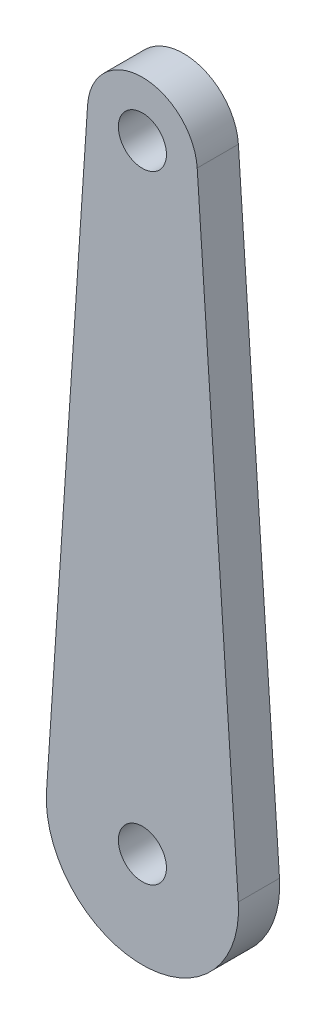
from build123d import *

# Parameters (mm, degrees)
SKETCH1_R      = 1.75
EXTRUDE1_DEPTH = 3


with BuildPart() as part:
    # Sketch1 → Extrude1 (new body)
    with BuildSketch(Plane.XY):
        with BuildLine():
            Line((-3.991101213, 45.266666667), (-6.984427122, 0.466666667))
            ThreePointArc((-6.984427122, 0.466666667), (0, -7), (6.984427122, 0.466666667))
            Line((6.984427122, 0.466666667), (3.991101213, 45.266666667))
            ThreePointArc((3.991101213, 45.266666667), (0, 49), (-3.991101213, 45.266666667))
        make_face()
        Circle(SKETCH1_R, mode=Mode.SUBTRACT)
        with Locations((0, 45)):
            Circle(SKETCH1_R, mode=Mode.SUBTRACT)
    extrude(amount=EXTRUDE1_DEPTH)


solid = part.part
